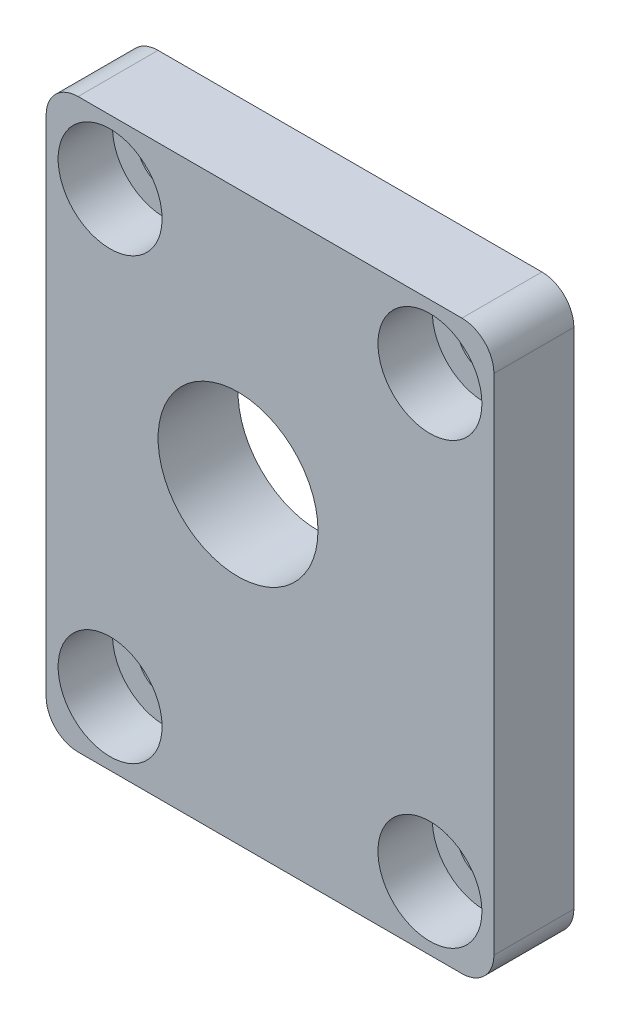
from build123d import *

# Parameters (mm, degrees)
SKIZZE1_W                                            = 28
SKIZZE1_H                                            = 35.5
SKIZZE1_R                                            = 5
AUFSATZ_LINEAR_AUSTRAGEN1_DEPTH                      = 5
STIRNSENKUNG_F_R_M3_ZYLINDERSCHRAUBE_MIT_D           = 3.4
STIRNSENKUNG_F_R_M3_ZYLINDERSCHRAUBE_MIT_CBORE_D     = 6.5
STIRNSENKUNG_F_R_M3_ZYLINDERSCHRAUBE_MIT_CBORE_DEPTH = 3.4
VERRUNDUNG1_R                                        = 2


with BuildPart() as part:
    # Skizze1 → Aufsatz-Linear austragen1 (new body)
    with BuildSketch(Plane.XY):
        Rectangle(SKIZZE1_W, SKIZZE1_H)
        with Locations((-2, 1.75)):
            Circle(SKIZZE1_R, mode=Mode.SUBTRACT)
    extrude(amount=AUFSATZ_LINEAR_AUSTRAGEN1_DEPTH)

    # Stirnsenkung f_r M3 Zylinderschraube mit (through all)
    with Locations(Plane.XY.offset(5)):
        with Locations((-10, 13.75), (10, 13.75), (10, -13.75), (-10, -13.75)):
            CounterBoreHole(STIRNSENKUNG_F_R_M3_ZYLINDERSCHRAUBE_MIT_D / 2, STIRNSENKUNG_F_R_M3_ZYLINDERSCHRAUBE_MIT_CBORE_D / 2, STIRNSENKUNG_F_R_M3_ZYLINDERSCHRAUBE_MIT_CBORE_DEPTH)

    # Verrundung1
    verrundung1_edges = [part.edges().sort_by_distance(p)[0] for p in [
        (14, -17.75, 2.5),
        (-14, -17.75, 2.5),
        (-14, 17.75, 2.5),
        (14, 17.75, 2.5),
    ]]
    fillet(verrundung1_edges, radius=VERRUNDUNG1_R)


solid = part.part
